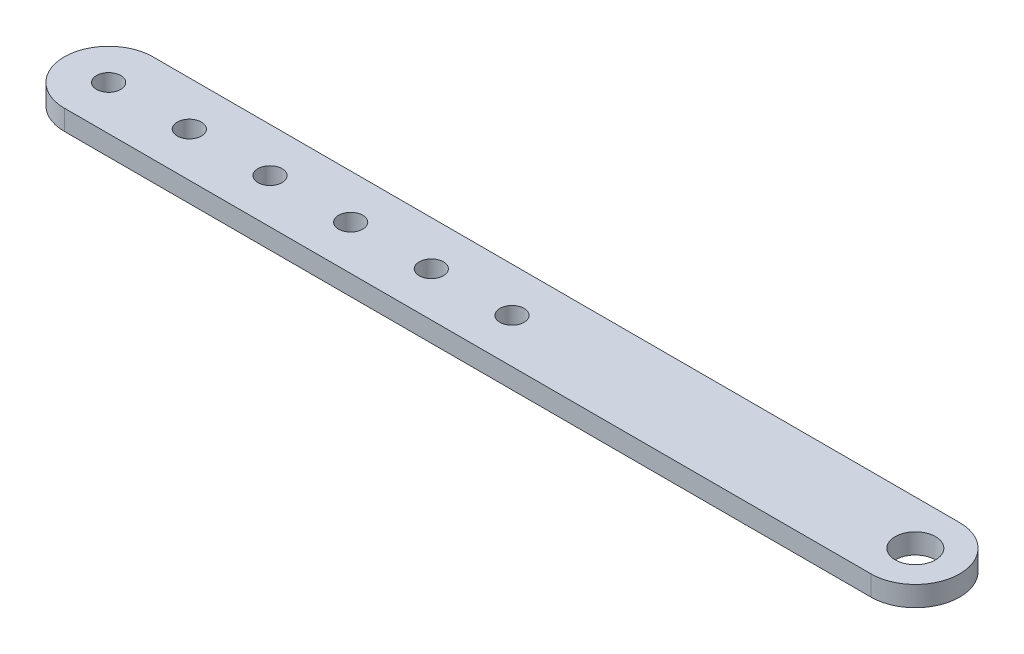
ISO-10303-21;
HEADER;
FILE_DESCRIPTION(('STEP AP214'),'2;1');
FILE_NAME('part.step','',(''),(''),'','','');
FILE_SCHEMA(('AUTOMOTIVE_DESIGN { 1 0 10303 214 1 1 1 1 }'));
ENDSEC;
DATA;
#1=APPLICATION_CONTEXT('core data for automotive mechanical design processes');
#2=APPLICATION_PROTOCOL_DEFINITION('international standard','automotive_design',2000,#1);
#3=PRODUCT_CONTEXT('',#1,'mechanical');
#4=PRODUCT('Part','Part','',(#3));
#5=PRODUCT_RELATED_PRODUCT_CATEGORY('part','',(#4));
#6=PRODUCT_DEFINITION_FORMATION('','',#4);
#7=PRODUCT_DEFINITION_CONTEXT('part definition',#1,'design');
#8=PRODUCT_DEFINITION('design','',#6,#7);
#9=PRODUCT_DEFINITION_SHAPE('','',#8);
#10=(LENGTH_UNIT() NAMED_UNIT(*) SI_UNIT(.MILLI.,.METRE.));
#11=(NAMED_UNIT(*) PLANE_ANGLE_UNIT() SI_UNIT($,.RADIAN.));
#12=(NAMED_UNIT(*) SI_UNIT($,.STERADIAN.) SOLID_ANGLE_UNIT());
#13=UNCERTAINTY_MEASURE_WITH_UNIT(LENGTH_MEASURE(1.E-05),#10,'distance_accuracy_value','');
#14=(GEOMETRIC_REPRESENTATION_CONTEXT(3) GLOBAL_UNCERTAINTY_ASSIGNED_CONTEXT((#13)) GLOBAL_UNIT_ASSIGNED_CONTEXT((#10,
#11,#12)) REPRESENTATION_CONTEXT('',''));
#15=CARTESIAN_POINT('',(0.,0.,0.));
#16=DIRECTION('',(0.,0.,1.));
#17=DIRECTION('',(1.,0.,0.));
#18=AXIS2_PLACEMENT_3D('',#15,#16,#17);
#19=CARTESIAN_POINT('',(0.,5.,0.));
#20=DIRECTION('',(0.,-1.,0.));
#21=DIRECTION('',(0.,0.,-1.));
#22=AXIS2_PLACEMENT_3D('',#19,#20,#21);
#23=CYLINDRICAL_SURFACE('',#22,11.);
#24=CARTESIAN_POINT('',(0.,0.,0.));
#25=DIRECTION('',(0.,1.,0.));
#26=DIRECTION('',(0.,0.,1.));
#27=AXIS2_PLACEMENT_3D('',#24,#25,#26);
#28=CIRCLE('',#27,11.);
#29=CARTESIAN_POINT('',(0.,0.,-11.));
#30=VERTEX_POINT('',#29);
#31=CARTESIAN_POINT('',(0.,0.,11.));
#32=VERTEX_POINT('',#31);
#33=EDGE_CURVE('E76',#30,#32,#28,.T.);
#34=ORIENTED_EDGE('',*,*,#33,.T.);
#35=DIRECTION('',(0.,-1.,0.));
#36=VECTOR('',#35,1.);
#37=CARTESIAN_POINT('',(0.,5.,11.));
#38=LINE('',#37,#36);
#39=CARTESIAN_POINT('',(0.,5.,11.));
#40=VERTEX_POINT('',#39);
#41=EDGE_CURVE('E82',#40,#32,#38,.T.);
#42=ORIENTED_EDGE('',*,*,#41,.F.);
#43=CARTESIAN_POINT('',(0.,5.,0.));
#44=DIRECTION('',(0.,1.,0.));
#45=DIRECTION('',(0.,0.,1.));
#46=AXIS2_PLACEMENT_3D('',#43,#44,#45);
#47=CIRCLE('',#46,11.);
#48=CARTESIAN_POINT('',(0.,5.,-11.));
#49=VERTEX_POINT('',#48);
#50=EDGE_CURVE('E100',#49,#40,#47,.T.);
#51=ORIENTED_EDGE('',*,*,#50,.F.);
#52=DIRECTION('',(0.,-1.,0.));
#53=VECTOR('',#52,1.);
#54=CARTESIAN_POINT('',(0.,5.,-11.));
#55=LINE('',#54,#53);
#56=EDGE_CURVE('E41',#49,#30,#55,.T.);
#57=ORIENTED_EDGE('',*,*,#56,.T.);
#58=EDGE_LOOP('',(#34,#42,#51,#57));
#59=FACE_BOUND('',#58,.T.);
#60=ADVANCED_FACE('F26',(#59),#23,.T.);
#61=CARTESIAN_POINT('',(0.,5.,11.));
#62=DIRECTION('',(0.,0.,-1.));
#63=DIRECTION('',(-1.,0.,0.));
#64=AXIS2_PLACEMENT_3D('',#61,#62,#63);
#65=PLANE('',#64);
#66=DIRECTION('',(1.,0.,0.));
#67=VECTOR('',#66,1.);
#68=CARTESIAN_POINT('',(0.,0.,11.));
#69=LINE('',#68,#67);
#70=CARTESIAN_POINT('',(200.,0.,11.));
#71=VERTEX_POINT('',#70);
#72=EDGE_CURVE('E70',#32,#71,#69,.T.);
#73=ORIENTED_EDGE('',*,*,#72,.T.);
#74=DIRECTION('',(0.,-1.,0.));
#75=VECTOR('',#74,1.);
#76=CARTESIAN_POINT('',(200.,5.,11.));
#77=LINE('',#76,#75);
#78=CARTESIAN_POINT('',(200.,5.,11.));
#79=VERTEX_POINT('',#78);
#80=EDGE_CURVE('E88',#79,#71,#77,.T.);
#81=ORIENTED_EDGE('',*,*,#80,.F.);
#82=DIRECTION('',(1.,0.,0.));
#83=VECTOR('',#82,1.);
#84=CARTESIAN_POINT('',(0.,5.,11.));
#85=LINE('',#84,#83);
#86=EDGE_CURVE('E84',#40,#79,#85,.T.);
#87=ORIENTED_EDGE('',*,*,#86,.F.);
#88=ORIENTED_EDGE('',*,*,#41,.T.);
#89=EDGE_LOOP('',(#73,#81,#87,#88));
#90=FACE_BOUND('',#89,.T.);
#91=ADVANCED_FACE('F83',(#90),#65,.F.);
#92=CARTESIAN_POINT('',(200.,5.,0.));
#93=DIRECTION('',(0.,-1.,0.));
#94=DIRECTION('',(0.,0.,-1.));
#95=AXIS2_PLACEMENT_3D('',#92,#93,#94);
#96=CYLINDRICAL_SURFACE('',#95,11.);
#97=CARTESIAN_POINT('',(200.,0.,0.));
#98=DIRECTION('',(0.,-1.,0.));
#99=DIRECTION('',(0.,0.,-1.));
#100=AXIS2_PLACEMENT_3D('',#97,#98,#99);
#101=CIRCLE('',#100,11.);
#102=CARTESIAN_POINT('',(200.,0.,-11.));
#103=VERTEX_POINT('',#102);
#104=EDGE_CURVE('E77',#103,#71,#101,.T.);
#105=ORIENTED_EDGE('',*,*,#104,.F.);
#106=DIRECTION('',(0.,-1.,0.));
#107=VECTOR('',#106,1.);
#108=CARTESIAN_POINT('',(200.,5.,-11.));
#109=LINE('',#108,#107);
#110=CARTESIAN_POINT('',(200.,5.,-11.));
#111=VERTEX_POINT('',#110);
#112=EDGE_CURVE('E49',#111,#103,#109,.T.);
#113=ORIENTED_EDGE('',*,*,#112,.F.);
#114=CARTESIAN_POINT('',(200.,5.,0.));
#115=DIRECTION('',(0.,-1.,0.));
#116=DIRECTION('',(0.,0.,-1.));
#117=AXIS2_PLACEMENT_3D('',#114,#115,#116);
#118=CIRCLE('',#117,11.);
#119=EDGE_CURVE('E103',#111,#79,#118,.T.);
#120=ORIENTED_EDGE('',*,*,#119,.T.);
#121=ORIENTED_EDGE('',*,*,#80,.T.);
#122=EDGE_LOOP('',(#105,#113,#120,#121));
#123=FACE_BOUND('',#122,.T.);
#124=ADVANCED_FACE('F148',(#123),#96,.T.);
#125=CARTESIAN_POINT('',(0.,5.,-11.));
#126=DIRECTION('',(0.,0.,-1.));
#127=DIRECTION('',(-1.,0.,0.));
#128=AXIS2_PLACEMENT_3D('',#125,#126,#127);
#129=PLANE('',#128);
#130=DIRECTION('',(1.,0.,0.));
#131=VECTOR('',#130,1.);
#132=CARTESIAN_POINT('',(0.,0.,-11.));
#133=LINE('',#132,#131);
#134=EDGE_CURVE('E98',#30,#103,#133,.T.);
#135=ORIENTED_EDGE('',*,*,#134,.F.);
#136=ORIENTED_EDGE('',*,*,#56,.F.);
#137=DIRECTION('',(1.,0.,0.));
#138=VECTOR('',#137,1.);
#139=CARTESIAN_POINT('',(0.,5.,-11.));
#140=LINE('',#139,#138);
#141=EDGE_CURVE('E105',#49,#111,#140,.T.);
#142=ORIENTED_EDGE('',*,*,#141,.T.);
#143=ORIENTED_EDGE('',*,*,#112,.T.);
#144=EDGE_LOOP('',(#135,#136,#142,#143));
#145=FACE_BOUND('',#144,.T.);
#146=ADVANCED_FACE('F138',(#145),#129,.T.);
#147=CARTESIAN_POINT('',(0.,5.,0.));
#148=DIRECTION('',(0.,1.,0.));
#149=DIRECTION('',(0.,0.,1.));
#150=AXIS2_PLACEMENT_3D('',#147,#148,#149);
#151=PLANE('',#150);
#152=CARTESIAN_POINT('',(200.,5.,0.));
#153=DIRECTION('',(0.,1.,0.));
#154=DIRECTION('',(0.,0.,1.));
#155=AXIS2_PLACEMENT_3D('',#152,#153,#154);
#156=CIRCLE('',#155,5.00000000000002);
#157=CARTESIAN_POINT('',(200.,5.,5.00000000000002));
#158=VERTEX_POINT('',#157);
#159=EDGE_CURVE('E233',#158,#158,#156,.T.);
#160=ORIENTED_EDGE('',*,*,#159,.F.);
#161=EDGE_LOOP('',(#160));
#162=FACE_BOUND('',#161,.T.);
#163=CARTESIAN_POINT('',(20.,5.,0.));
#164=DIRECTION('',(0.,1.,0.));
#165=DIRECTION('',(0.,0.,1.));
#166=AXIS2_PLACEMENT_3D('',#163,#164,#165);
#167=CIRCLE('',#166,3.);
#168=CARTESIAN_POINT('',(20.,5.,3.));
#169=VERTEX_POINT('',#168);
#170=EDGE_CURVE('E225',#169,#169,#167,.T.);
#171=ORIENTED_EDGE('',*,*,#170,.F.);
#172=EDGE_LOOP('',(#171));
#173=FACE_BOUND('',#172,.T.);
#174=CARTESIAN_POINT('',(0.,5.,0.));
#175=DIRECTION('',(0.,1.,0.));
#176=DIRECTION('',(0.,0.,1.));
#177=AXIS2_PLACEMENT_3D('',#174,#175,#176);
#178=CIRCLE('',#177,3.);
#179=CARTESIAN_POINT('',(0.,5.,3.));
#180=VERTEX_POINT('',#179);
#181=EDGE_CURVE('E93',#180,#180,#178,.T.);
#182=ORIENTED_EDGE('',*,*,#181,.F.);
#183=EDGE_LOOP('',(#182));
#184=FACE_BOUND('',#183,.T.);
#185=ORIENTED_EDGE('',*,*,#50,.T.);
#186=ORIENTED_EDGE('',*,*,#86,.T.);
#187=ORIENTED_EDGE('',*,*,#119,.F.);
#188=ORIENTED_EDGE('',*,*,#141,.F.);
#189=EDGE_LOOP('',(#185,#186,#187,#188));
#190=FACE_BOUND('',#189,.T.);
#191=CARTESIAN_POINT('',(40.,5.,0.));
#192=DIRECTION('',(0.,1.,0.));
#193=DIRECTION('',(0.,0.,1.));
#194=AXIS2_PLACEMENT_3D('',#191,#192,#193);
#195=CIRCLE('',#194,3.);
#196=CARTESIAN_POINT('',(40.,5.,3.));
#197=VERTEX_POINT('',#196);
#198=EDGE_CURVE('E112',#197,#197,#195,.T.);
#199=ORIENTED_EDGE('',*,*,#198,.F.);
#200=EDGE_LOOP('',(#199));
#201=FACE_BOUND('',#200,.T.);
#202=CARTESIAN_POINT('',(60.,5.,0.));
#203=DIRECTION('',(0.,1.,0.));
#204=DIRECTION('',(0.,0.,1.));
#205=AXIS2_PLACEMENT_3D('',#202,#203,#204);
#206=CIRCLE('',#205,3.);
#207=CARTESIAN_POINT('',(60.,5.,3.));
#208=VERTEX_POINT('',#207);
#209=EDGE_CURVE('E118',#208,#208,#206,.T.);
#210=ORIENTED_EDGE('',*,*,#209,.F.);
#211=EDGE_LOOP('',(#210));
#212=FACE_BOUND('',#211,.T.);
#213=CARTESIAN_POINT('',(80.,5.,0.));
#214=DIRECTION('',(0.,1.,0.));
#215=DIRECTION('',(0.,0.,1.));
#216=AXIS2_PLACEMENT_3D('',#213,#214,#215);
#217=CIRCLE('',#216,3.);
#218=CARTESIAN_POINT('',(80.,5.,3.));
#219=VERTEX_POINT('',#218);
#220=EDGE_CURVE('E124',#219,#219,#217,.T.);
#221=ORIENTED_EDGE('',*,*,#220,.F.);
#222=EDGE_LOOP('',(#221));
#223=FACE_BOUND('',#222,.T.);
#224=CARTESIAN_POINT('',(100.,5.,0.));
#225=DIRECTION('',(0.,1.,0.));
#226=DIRECTION('',(0.,0.,1.));
#227=AXIS2_PLACEMENT_3D('',#224,#225,#226);
#228=CIRCLE('',#227,3.);
#229=CARTESIAN_POINT('',(100.,5.,3.));
#230=VERTEX_POINT('',#229);
#231=EDGE_CURVE('E11',#230,#230,#228,.T.);
#232=ORIENTED_EDGE('',*,*,#231,.F.);
#233=EDGE_LOOP('',(#232));
#234=FACE_BOUND('',#233,.T.);
#235=ADVANCED_FACE('F136',(#162,#173,#184,#190,#201,#212,#223,#234),#151,.T.);
#236=CARTESIAN_POINT('',(0.,0.,0.));
#237=DIRECTION('',(0.,1.,0.));
#238=DIRECTION('',(0.,0.,1.));
#239=AXIS2_PLACEMENT_3D('',#236,#237,#238);
#240=PLANE('',#239);
#241=CARTESIAN_POINT('',(200.,0.,0.));
#242=DIRECTION('',(0.,1.,0.));
#243=DIRECTION('',(0.,0.,1.));
#244=AXIS2_PLACEMENT_3D('',#241,#242,#243);
#245=CIRCLE('',#244,5.00000000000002);
#246=CARTESIAN_POINT('',(200.,0.,5.00000000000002));
#247=VERTEX_POINT('',#246);
#248=EDGE_CURVE('E228',#247,#247,#245,.T.);
#249=ORIENTED_EDGE('',*,*,#248,.T.);
#250=EDGE_LOOP('',(#249));
#251=FACE_BOUND('',#250,.T.);
#252=CARTESIAN_POINT('',(20.,0.,0.));
#253=DIRECTION('',(0.,1.,0.));
#254=DIRECTION('',(0.,0.,1.));
#255=AXIS2_PLACEMENT_3D('',#252,#253,#254);
#256=CIRCLE('',#255,3.);
#257=CARTESIAN_POINT('',(20.,0.,3.));
#258=VERTEX_POINT('',#257);
#259=EDGE_CURVE('E222',#258,#258,#256,.T.);
#260=ORIENTED_EDGE('',*,*,#259,.T.);
#261=EDGE_LOOP('',(#260));
#262=FACE_BOUND('',#261,.T.);
#263=CARTESIAN_POINT('',(0.,0.,0.));
#264=DIRECTION('',(0.,1.,0.));
#265=DIRECTION('',(0.,0.,1.));
#266=AXIS2_PLACEMENT_3D('',#263,#264,#265);
#267=CIRCLE('',#266,3.);
#268=CARTESIAN_POINT('',(0.,0.,3.));
#269=VERTEX_POINT('',#268);
#270=EDGE_CURVE('E90',#269,#269,#267,.T.);
#271=ORIENTED_EDGE('',*,*,#270,.T.);
#272=EDGE_LOOP('',(#271));
#273=FACE_BOUND('',#272,.T.);
#274=ORIENTED_EDGE('',*,*,#33,.F.);
#275=ORIENTED_EDGE('',*,*,#134,.T.);
#276=ORIENTED_EDGE('',*,*,#104,.T.);
#277=ORIENTED_EDGE('',*,*,#72,.F.);
#278=EDGE_LOOP('',(#274,#275,#276,#277));
#279=FACE_BOUND('',#278,.T.);
#280=CARTESIAN_POINT('',(40.,0.,0.));
#281=DIRECTION('',(0.,1.,0.));
#282=DIRECTION('',(0.,0.,1.));
#283=AXIS2_PLACEMENT_3D('',#280,#281,#282);
#284=CIRCLE('',#283,3.);
#285=CARTESIAN_POINT('',(40.,0.,3.));
#286=VERTEX_POINT('',#285);
#287=EDGE_CURVE('E87',#286,#286,#284,.T.);
#288=ORIENTED_EDGE('',*,*,#287,.T.);
#289=EDGE_LOOP('',(#288));
#290=FACE_BOUND('',#289,.T.);
#291=CARTESIAN_POINT('',(60.,0.,0.));
#292=DIRECTION('',(0.,1.,0.));
#293=DIRECTION('',(0.,0.,1.));
#294=AXIS2_PLACEMENT_3D('',#291,#292,#293);
#295=CIRCLE('',#294,3.);
#296=CARTESIAN_POINT('',(60.,0.,3.));
#297=VERTEX_POINT('',#296);
#298=EDGE_CURVE('E115',#297,#297,#295,.T.);
#299=ORIENTED_EDGE('',*,*,#298,.T.);
#300=EDGE_LOOP('',(#299));
#301=FACE_BOUND('',#300,.T.);
#302=CARTESIAN_POINT('',(80.,0.,0.));
#303=DIRECTION('',(0.,1.,0.));
#304=DIRECTION('',(0.,0.,1.));
#305=AXIS2_PLACEMENT_3D('',#302,#303,#304);
#306=CIRCLE('',#305,3.);
#307=CARTESIAN_POINT('',(80.,0.,3.));
#308=VERTEX_POINT('',#307);
#309=EDGE_CURVE('E121',#308,#308,#306,.T.);
#310=ORIENTED_EDGE('',*,*,#309,.T.);
#311=EDGE_LOOP('',(#310));
#312=FACE_BOUND('',#311,.T.);
#313=CARTESIAN_POINT('',(100.,0.,0.));
#314=DIRECTION('',(0.,1.,0.));
#315=DIRECTION('',(0.,0.,1.));
#316=AXIS2_PLACEMENT_3D('',#313,#314,#315);
#317=CIRCLE('',#316,3.);
#318=CARTESIAN_POINT('',(100.,0.,3.));
#319=VERTEX_POINT('',#318);
#320=EDGE_CURVE('E34',#319,#319,#317,.T.);
#321=ORIENTED_EDGE('',*,*,#320,.T.);
#322=EDGE_LOOP('',(#321));
#323=FACE_BOUND('',#322,.T.);
#324=ADVANCED_FACE('F72',(#251,#262,#273,#279,#290,#301,#312,#323),#240,.F.);
#325=CARTESIAN_POINT('',(0.,0.,0.));
#326=DIRECTION('',(0.,1.,0.));
#327=DIRECTION('',(0.,0.,1.));
#328=AXIS2_PLACEMENT_3D('',#325,#326,#327);
#329=CYLINDRICAL_SURFACE('',#328,3.);
#330=ORIENTED_EDGE('',*,*,#270,.F.);
#331=EDGE_LOOP('',(#330));
#332=FACE_BOUND('',#331,.T.);
#333=ORIENTED_EDGE('',*,*,#181,.T.);
#334=EDGE_LOOP('',(#333));
#335=FACE_BOUND('',#334,.T.);
#336=ADVANCED_FACE('F144',(#332,#335),#329,.F.);
#337=CARTESIAN_POINT('',(20.,0.,0.));
#338=DIRECTION('',(0.,1.,0.));
#339=DIRECTION('',(0.,0.,1.));
#340=AXIS2_PLACEMENT_3D('',#337,#338,#339);
#341=CYLINDRICAL_SURFACE('',#340,3.);
#342=ORIENTED_EDGE('',*,*,#259,.F.);
#343=EDGE_LOOP('',(#342));
#344=FACE_BOUND('',#343,.T.);
#345=ORIENTED_EDGE('',*,*,#170,.T.);
#346=EDGE_LOOP('',(#345));
#347=FACE_BOUND('',#346,.T.);
#348=ADVANCED_FACE('F164',(#344,#347),#341,.F.);
#349=CARTESIAN_POINT('',(40.,0.,0.));
#350=DIRECTION('',(0.,1.,0.));
#351=DIRECTION('',(0.,0.,1.));
#352=AXIS2_PLACEMENT_3D('',#349,#350,#351);
#353=CYLINDRICAL_SURFACE('',#352,3.);
#354=ORIENTED_EDGE('',*,*,#287,.F.);
#355=EDGE_LOOP('',(#354));
#356=FACE_BOUND('',#355,.T.);
#357=ORIENTED_EDGE('',*,*,#198,.T.);
#358=EDGE_LOOP('',(#357));
#359=FACE_BOUND('',#358,.T.);
#360=ADVANCED_FACE('F160',(#356,#359),#353,.F.);
#361=CARTESIAN_POINT('',(60.,0.,0.));
#362=DIRECTION('',(0.,1.,0.));
#363=DIRECTION('',(0.,0.,1.));
#364=AXIS2_PLACEMENT_3D('',#361,#362,#363);
#365=CYLINDRICAL_SURFACE('',#364,3.);
#366=ORIENTED_EDGE('',*,*,#298,.F.);
#367=EDGE_LOOP('',(#366));
#368=FACE_BOUND('',#367,.T.);
#369=ORIENTED_EDGE('',*,*,#209,.T.);
#370=EDGE_LOOP('',(#369));
#371=FACE_BOUND('',#370,.T.);
#372=ADVANCED_FACE('F163',(#368,#371),#365,.F.);
#373=CARTESIAN_POINT('',(80.,0.,0.));
#374=DIRECTION('',(0.,1.,0.));
#375=DIRECTION('',(0.,0.,1.));
#376=AXIS2_PLACEMENT_3D('',#373,#374,#375);
#377=CYLINDRICAL_SURFACE('',#376,3.);
#378=ORIENTED_EDGE('',*,*,#309,.F.);
#379=EDGE_LOOP('',(#378));
#380=FACE_BOUND('',#379,.T.);
#381=ORIENTED_EDGE('',*,*,#220,.T.);
#382=EDGE_LOOP('',(#381));
#383=FACE_BOUND('',#382,.T.);
#384=ADVANCED_FACE('F133',(#380,#383),#377,.F.);
#385=CARTESIAN_POINT('',(100.,0.,0.));
#386=DIRECTION('',(0.,1.,0.));
#387=DIRECTION('',(0.,0.,1.));
#388=AXIS2_PLACEMENT_3D('',#385,#386,#387);
#389=CYLINDRICAL_SURFACE('',#388,3.);
#390=ORIENTED_EDGE('',*,*,#320,.F.);
#391=EDGE_LOOP('',(#390));
#392=FACE_BOUND('',#391,.T.);
#393=ORIENTED_EDGE('',*,*,#231,.T.);
#394=EDGE_LOOP('',(#393));
#395=FACE_BOUND('',#394,.T.);
#396=ADVANCED_FACE('F28',(#392,#395),#389,.F.);
#397=CARTESIAN_POINT('',(200.,0.,0.));
#398=DIRECTION('',(0.,1.,0.));
#399=DIRECTION('',(0.,0.,1.));
#400=AXIS2_PLACEMENT_3D('',#397,#398,#399);
#401=CYLINDRICAL_SURFACE('',#400,5.00000000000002);
#402=ORIENTED_EDGE('',*,*,#248,.F.);
#403=EDGE_LOOP('',(#402));
#404=FACE_BOUND('',#403,.T.);
#405=ORIENTED_EDGE('',*,*,#159,.T.);
#406=EDGE_LOOP('',(#405));
#407=FACE_BOUND('',#406,.T.);
#408=ADVANCED_FACE('F132',(#404,#407),#401,.F.);
#409=CLOSED_SHELL('',(#60,#91,#124,#146,#235,#324,#336,#348,#360,#372,#384,#396,#408));
#410=MANIFOLD_SOLID_BREP('B2',#409);
#411=ADVANCED_BREP_SHAPE_REPRESENTATION('',(#18,#410),#14);
#412=SHAPE_DEFINITION_REPRESENTATION(#9,#411);
ENDSEC;
END-ISO-10303-21;
